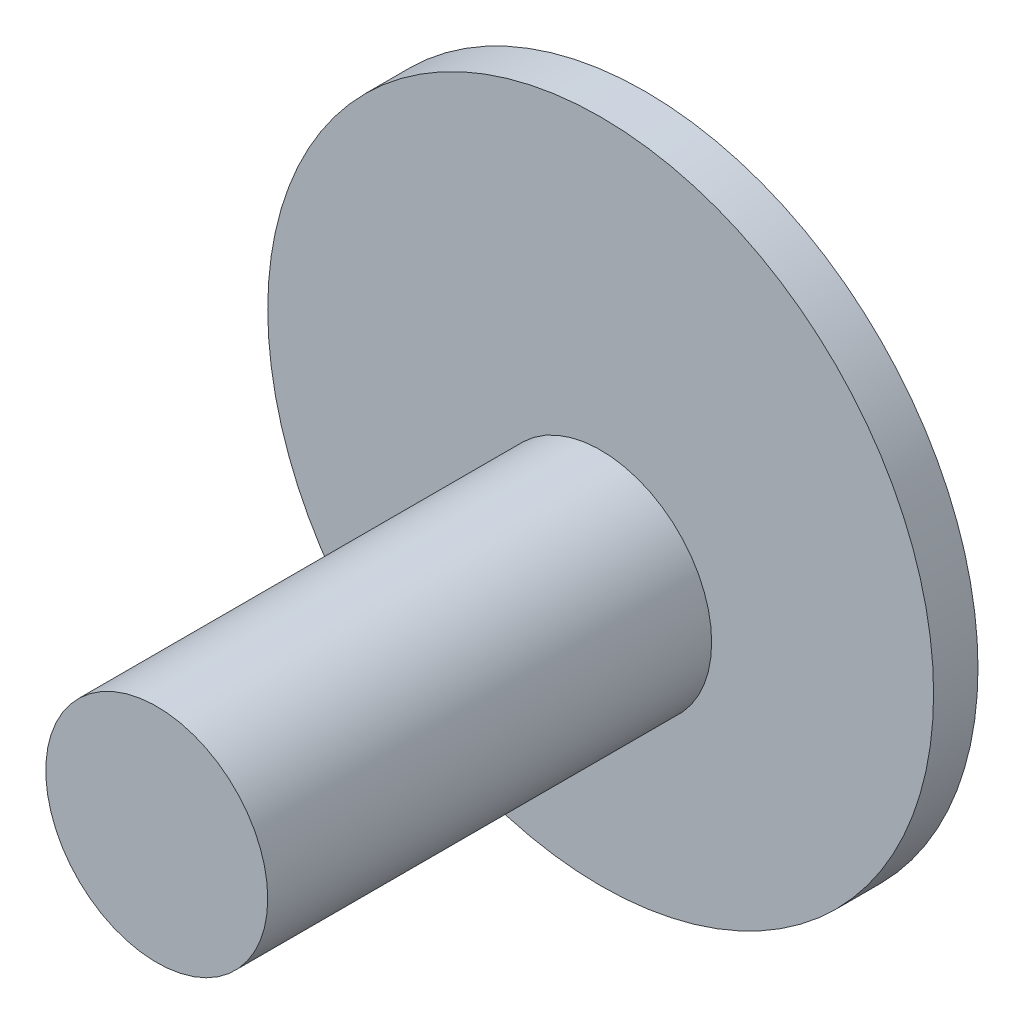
ISO-10303-21;
HEADER;
FILE_DESCRIPTION(('STEP AP214'),'2;1');
FILE_NAME('part.step','',(''),(''),'','','');
FILE_SCHEMA(('AUTOMOTIVE_DESIGN { 1 0 10303 214 1 1 1 1 }'));
ENDSEC;
DATA;
#1=APPLICATION_CONTEXT('core data for automotive mechanical design processes');
#2=APPLICATION_PROTOCOL_DEFINITION('international standard','automotive_design',2000,#1);
#3=PRODUCT_CONTEXT('',#1,'mechanical');
#4=PRODUCT('Part','Part','',(#3));
#5=PRODUCT_RELATED_PRODUCT_CATEGORY('part','',(#4));
#6=PRODUCT_DEFINITION_FORMATION('','',#4);
#7=PRODUCT_DEFINITION_CONTEXT('part definition',#1,'design');
#8=PRODUCT_DEFINITION('design','',#6,#7);
#9=PRODUCT_DEFINITION_SHAPE('','',#8);
#10=(LENGTH_UNIT() NAMED_UNIT(*) SI_UNIT(.MILLI.,.METRE.));
#11=(NAMED_UNIT(*) PLANE_ANGLE_UNIT() SI_UNIT($,.RADIAN.));
#12=(NAMED_UNIT(*) SI_UNIT($,.STERADIAN.) SOLID_ANGLE_UNIT());
#13=UNCERTAINTY_MEASURE_WITH_UNIT(LENGTH_MEASURE(1.E-05),#10,'distance_accuracy_value','');
#14=(GEOMETRIC_REPRESENTATION_CONTEXT(3) GLOBAL_UNCERTAINTY_ASSIGNED_CONTEXT((#13)) GLOBAL_UNIT_ASSIGNED_CONTEXT((#10,
#11,#12)) REPRESENTATION_CONTEXT('',''));
#15=CARTESIAN_POINT('',(0.,0.,0.));
#16=DIRECTION('',(0.,0.,1.));
#17=DIRECTION('',(1.,0.,0.));
#18=AXIS2_PLACEMENT_3D('',#15,#16,#17);
#19=CARTESIAN_POINT('',(0.,0.,2.));
#20=DIRECTION('',(0.,0.,1.));
#21=DIRECTION('',(1.,0.,0.));
#22=AXIS2_PLACEMENT_3D('',#19,#20,#21);
#23=PLANE('',#22);
#24=CARTESIAN_POINT('',(0.,0.,2.));
#25=DIRECTION('',(0.,0.,1.));
#26=DIRECTION('',(1.,0.,0.));
#27=AXIS2_PLACEMENT_3D('',#24,#25,#26);
#28=CIRCLE('',#27,15.);
#29=CARTESIAN_POINT('',(15.,0.,2.));
#30=VERTEX_POINT('',#29);
#31=EDGE_CURVE('E10',#30,#30,#28,.T.);
#32=ORIENTED_EDGE('',*,*,#31,.T.);
#33=EDGE_LOOP('',(#32));
#34=FACE_BOUND('',#33,.T.);
#35=CARTESIAN_POINT('',(0.,-3.,2.));
#36=DIRECTION('',(0.,0.,1.));
#37=DIRECTION('',(1.,0.,0.));
#38=AXIS2_PLACEMENT_3D('',#35,#36,#37);
#39=CIRCLE('',#38,5.);
#40=CARTESIAN_POINT('',(5.,-3.,2.));
#41=VERTEX_POINT('',#40);
#42=EDGE_CURVE('E1366',#41,#41,#39,.T.);
#43=ORIENTED_EDGE('',*,*,#42,.F.);
#44=EDGE_LOOP('',(#43));
#45=FACE_BOUND('',#44,.T.);
#46=ADVANCED_FACE('F1351',(#34,#45),#23,.T.);
#47=CARTESIAN_POINT('',(0.,0.,2.));
#48=DIRECTION('',(0.,0.,-1.));
#49=DIRECTION('',(-1.,0.,0.));
#50=AXIS2_PLACEMENT_3D('',#47,#48,#49);
#51=CYLINDRICAL_SURFACE('',#50,15.);
#52=ORIENTED_EDGE('',*,*,#31,.F.);
#53=EDGE_LOOP('',(#52));
#54=FACE_BOUND('',#53,.T.);
#55=CARTESIAN_POINT('',(0.,0.,0.));
#56=DIRECTION('',(0.,0.,1.));
#57=DIRECTION('',(1.,0.,0.));
#58=AXIS2_PLACEMENT_3D('',#55,#56,#57);
#59=CIRCLE('',#58,15.);
#60=CARTESIAN_POINT('',(15.,0.,0.));
#61=VERTEX_POINT('',#60);
#62=EDGE_CURVE('E1358',#61,#61,#59,.T.);
#63=ORIENTED_EDGE('',*,*,#62,.T.);
#64=EDGE_LOOP('',(#63));
#65=FACE_BOUND('',#64,.T.);
#66=ADVANCED_FACE('F1353',(#54,#65),#51,.T.);
#67=CARTESIAN_POINT('',(0.,0.,0.));
#68=DIRECTION('',(0.,0.,1.));
#69=DIRECTION('',(1.,0.,0.));
#70=AXIS2_PLACEMENT_3D('',#67,#68,#69);
#71=PLANE('',#70);
#72=ORIENTED_EDGE('',*,*,#62,.F.);
#73=EDGE_LOOP('',(#72));
#74=FACE_BOUND('',#73,.T.);
#75=ADVANCED_FACE('F1380',(#74),#71,.F.);
#76=CARTESIAN_POINT('',(0.,-3.,22.));
#77=DIRECTION('',(0.,0.,-1.));
#78=DIRECTION('',(-1.,0.,0.));
#79=AXIS2_PLACEMENT_3D('',#76,#77,#78);
#80=CYLINDRICAL_SURFACE('',#79,5.);
#81=CARTESIAN_POINT('',(0.,-3.,22.));
#82=DIRECTION('',(0.,0.,1.));
#83=DIRECTION('',(1.,0.,0.));
#84=AXIS2_PLACEMENT_3D('',#81,#82,#83);
#85=CIRCLE('',#84,5.);
#86=CARTESIAN_POINT('',(5.,-3.,22.));
#87=VERTEX_POINT('',#86);
#88=EDGE_CURVE('E1362',#87,#87,#85,.T.);
#89=ORIENTED_EDGE('',*,*,#88,.F.);
#90=EDGE_LOOP('',(#89));
#91=FACE_BOUND('',#90,.T.);
#92=ORIENTED_EDGE('',*,*,#42,.T.);
#93=EDGE_LOOP('',(#92));
#94=FACE_BOUND('',#93,.T.);
#95=ADVANCED_FACE('F1372',(#91,#94),#80,.T.);
#96=CARTESIAN_POINT('',(0.,-3.,22.));
#97=DIRECTION('',(0.,0.,1.));
#98=DIRECTION('',(1.,0.,0.));
#99=AXIS2_PLACEMENT_3D('',#96,#97,#98);
#100=PLANE('',#99);
#101=ORIENTED_EDGE('',*,*,#88,.T.);
#102=EDGE_LOOP('',(#101));
#103=FACE_BOUND('',#102,.T.);
#104=ADVANCED_FACE('F1386',(#103),#100,.T.);
#105=CLOSED_SHELL('',(#46,#66,#75,#95,#104));
#106=MANIFOLD_SOLID_BREP('B2',#105);
#107=ADVANCED_BREP_SHAPE_REPRESENTATION('',(#18,#106),#14);
#108=SHAPE_DEFINITION_REPRESENTATION(#9,#107);
ENDSEC;
END-ISO-10303-21;
